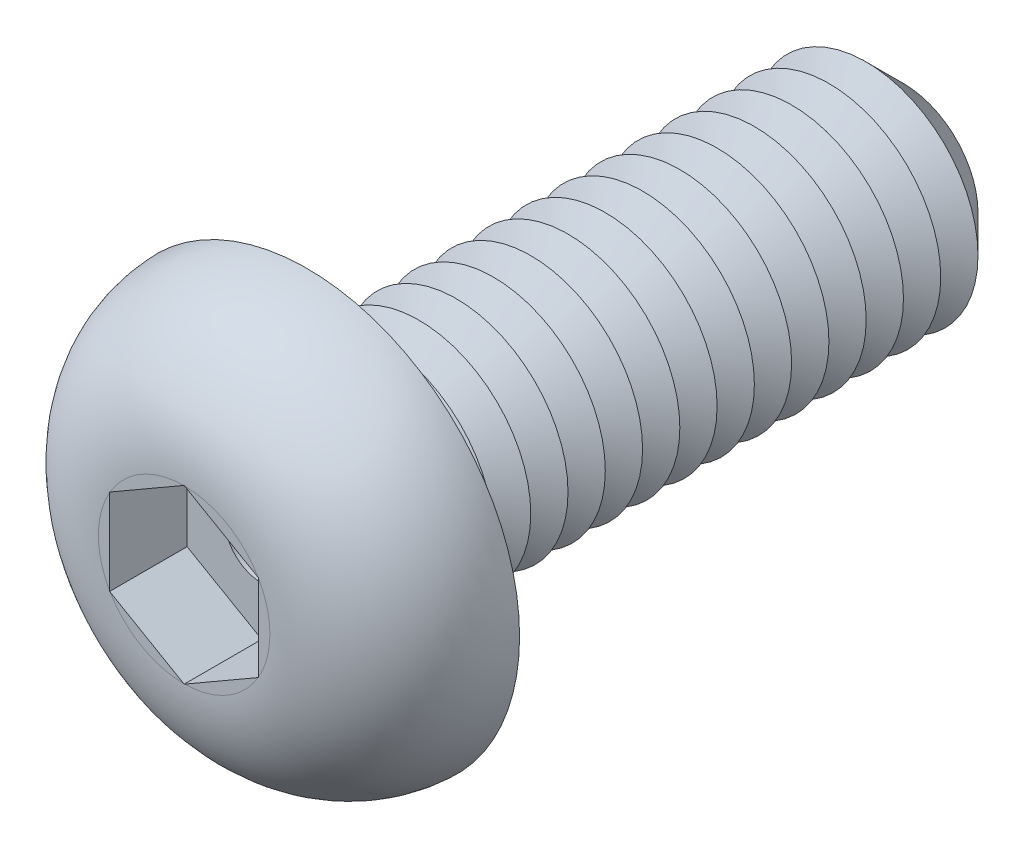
from build123d import *

# Parameters (mm, degrees)
CUT_EXTRUDE1_DEPTH  = 1.04
SKETCH4_R           = 1.5
BOSS_EXTRUDE1_DEPTH = 8
CHAMFER1_SIZE       = 0.5
LPATTERN1_COUNT     = 14
LPATTERN1_PITCH     = 0.5
FILLET2_R           = 0.25
SKETCH6_R           = 0.5
CUT_EXTRUDE2_DEPTH  = 8.61


with BuildPart() as part:
    # Sketch2 → Revolve1 (revolve)
    with BuildSketch(Plane(origin=(0, 0, 0), x_dir=(0, 0, -1), z_dir=(1, 0, 0)), mode=Mode.PRIVATE) as revolve1_sk:
        with BuildLine():
            Line((0, 0), (-1.65, 0))
            Line((-1.65, 0), (-1.65, 1.150735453))
            ThreePointArc((-1.65, 1.150735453), (-1.169631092, 2.335007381), (0, 2.85))
            Line((0, 2.85), (0, 0))
        make_face()
    revolve(revolve1_sk.sketch.rotate(Axis((0, 0, 47.934239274), (0, 0, -1)), 90), axis=Axis((0, 0, 47.934239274), (0, 0, -1)))

    # Sketch3 → Cut-Extrude1 (cut)
    with BuildSketch(Plane.XY.offset(1.65)):
        Polygon((0, 1.154700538), (-1, 0.577350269), (-1, -0.577350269), (0, -1.154700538), (1, -0.577350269), (1, 0.577350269), align=None)
    extrude(amount=-CUT_EXTRUDE1_DEPTH, mode=Mode.SUBTRACT)


with BuildPart() as cut_extrude1_kept_piece:
    # of the separate pieces the step leaves, the one the design keeps (cut_extrude1_pieces_kept)
    add(part.part.solids().sort_by_distance((2.85, 0, 0))[0])

    # Sketch4 → Boss-Extrude1 (add)
    with BuildSketch(Plane(origin=(0, 0, 0), x_dir=(-1, 0, 0), z_dir=(0, 0, -1))):
        with Locations(Location((0, 0, 0), (0, 0, 180))):
            Circle(SKETCH4_R)
    extrude(amount=BOSS_EXTRUDE1_DEPTH)

    # Chamfer1
    chamfer1_edges = [cut_extrude1_kept_piece.edges().sort_by_distance(p)[0] for p in [
        (-1.5, 0, -8),
    ]]
    chamfer(chamfer1_edges, length=CHAMFER1_SIZE)

    # Sketch5 → Cut-Revolve1 (revolve, cut)
    with BuildSketch(Plane(origin=(0, 0, 0), x_dir=(0, 0, -1), z_dir=(1, 0, 0)), mode=Mode.PRIVATE) as cut_revolve1_sk:
        Polygon((0.5, 1.5), (1, 1.5), (0.75, 1.066987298), align=None)
    cut_revolve1 = revolve(cut_revolve1_sk.sketch.rotate(Axis((0, 0, 47.934239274), (0, 0, -1)), 90), axis=Axis((0, 0, 47.934239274), (0, 0, -1)), mode=Mode.SUBTRACT)

    # LPattern1: Cut-Revolve1 ×14
    with Locations(*[(0, 0, -i * LPATTERN1_PITCH) for i in range(1, LPATTERN1_COUNT)]):
        add(cut_revolve1, mode=Mode.SUBTRACT)

    # Fillet2
    fillet2_edges = [cut_extrude1_kept_piece.edges().sort_by_distance(p)[0] for p in [
        (-1.5, 0, 0),
    ]]
    fillet(fillet2_edges, radius=FILLET2_R)

    # Sketch6 → Cut-Extrude2 (cut)
    with BuildSketch(Plane.XY.offset(0.61)):
        Circle(SKETCH6_R)
    extrude(amount=-CUT_EXTRUDE2_DEPTH, mode=Mode.SUBTRACT)


solid = cut_extrude1_kept_piece.part
